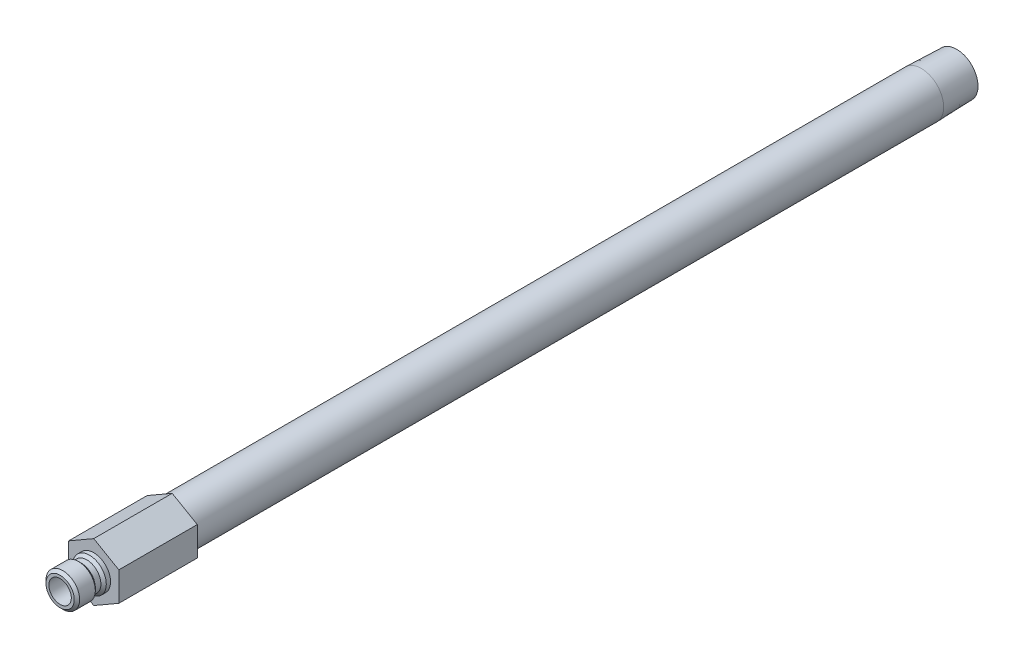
ISO-10303-21;
HEADER;
FILE_DESCRIPTION(('STEP AP214'),'2;1');
FILE_NAME('part.step','',(''),(''),'','','');
FILE_SCHEMA(('AUTOMOTIVE_DESIGN { 1 0 10303 214 1 1 1 1 }'));
ENDSEC;
DATA;
#1=APPLICATION_CONTEXT('core data for automotive mechanical design processes');
#2=APPLICATION_PROTOCOL_DEFINITION('international standard','automotive_design',2000,#1);
#3=PRODUCT_CONTEXT('',#1,'mechanical');
#4=PRODUCT('Part','Part','',(#3));
#5=PRODUCT_RELATED_PRODUCT_CATEGORY('part','',(#4));
#6=PRODUCT_DEFINITION_FORMATION('','',#4);
#7=PRODUCT_DEFINITION_CONTEXT('part definition',#1,'design');
#8=PRODUCT_DEFINITION('design','',#6,#7);
#9=PRODUCT_DEFINITION_SHAPE('','',#8);
#10=(LENGTH_UNIT() NAMED_UNIT(*) SI_UNIT(.MILLI.,.METRE.));
#11=(NAMED_UNIT(*) PLANE_ANGLE_UNIT() SI_UNIT($,.RADIAN.));
#12=(NAMED_UNIT(*) SI_UNIT($,.STERADIAN.) SOLID_ANGLE_UNIT());
#13=UNCERTAINTY_MEASURE_WITH_UNIT(LENGTH_MEASURE(1.E-05),#10,'distance_accuracy_value','');
#14=(GEOMETRIC_REPRESENTATION_CONTEXT(3) GLOBAL_UNCERTAINTY_ASSIGNED_CONTEXT((#13)) GLOBAL_UNIT_ASSIGNED_CONTEXT((#10,
#11,#12)) REPRESENTATION_CONTEXT('',''));
#15=CARTESIAN_POINT('',(0.,0.,0.));
#16=DIRECTION('',(0.,0.,1.));
#17=DIRECTION('',(1.,0.,0.));
#18=AXIS2_PLACEMENT_3D('',#15,#16,#17);
#19=CARTESIAN_POINT('',(0.,0.,0.));
#20=DIRECTION('',(0.,0.,-1.));
#21=DIRECTION('',(0.,1.,0.));
#22=AXIS2_PLACEMENT_3D('',#19,#20,#21);
#23=CYLINDRICAL_SURFACE('',#22,6.34999999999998);
#24=CARTESIAN_POINT('',(0.,0.,-234.442));
#25=DIRECTION('',(0.,0.,-1.));
#26=DIRECTION('',(0.,1.,0.));
#27=AXIS2_PLACEMENT_3D('',#24,#25,#26);
#28=CIRCLE('',#27,6.34999999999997);
#29=CARTESIAN_POINT('',(0.,6.35,-234.442));
#30=VERTEX_POINT('',#29);
#31=EDGE_CURVE('E41',#30,#30,#28,.T.);
#32=ORIENTED_EDGE('',*,*,#31,.F.);
#33=EDGE_LOOP('',(#32));
#34=FACE_BOUND('',#33,.T.);
#35=CARTESIAN_POINT('',(0.,0.,-22.225));
#36=DIRECTION('',(0.,0.,1.));
#37=DIRECTION('',(1.,0.,0.));
#38=AXIS2_PLACEMENT_3D('',#35,#36,#37);
#39=CIRCLE('',#38,6.34999999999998);
#40=CARTESIAN_POINT('',(6.34999999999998,0.,-22.225));
#41=VERTEX_POINT('',#40);
#42=EDGE_CURVE('E137',#41,#41,#39,.F.);
#43=ORIENTED_EDGE('',*,*,#42,.T.);
#44=EDGE_LOOP('',(#43));
#45=FACE_BOUND('',#44,.T.);
#46=ADVANCED_FACE('F32',(#34,#45),#23,.T.);
#47=CARTESIAN_POINT('',(0.,6.03647060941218,-244.475));
#48=DIRECTION('',(0.,0.,-1.));
#49=DIRECTION('',(0.,1.,0.));
#50=AXIS2_PLACEMENT_3D('',#47,#48,#49);
#51=PLANE('',#50);
#52=CARTESIAN_POINT('',(0.,0.,-244.475));
#53=DIRECTION('',(0.,0.,-1.));
#54=DIRECTION('',(0.,1.,0.));
#55=AXIS2_PLACEMENT_3D('',#52,#53,#54);
#56=CIRCLE('',#55,6.03647060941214);
#57=CARTESIAN_POINT('',(0.,6.03647060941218,-244.475));
#58=VERTEX_POINT('',#57);
#59=EDGE_CURVE('E11',#58,#58,#56,.T.);
#60=ORIENTED_EDGE('',*,*,#59,.T.);
#61=EDGE_LOOP('',(#60));
#62=FACE_BOUND('',#61,.T.);
#63=CARTESIAN_POINT('',(0.,0.,-244.475));
#64=DIRECTION('',(0.,0.,-1.));
#65=DIRECTION('',(0.,1.,0.));
#66=AXIS2_PLACEMENT_3D('',#63,#64,#65);
#67=CIRCLE('',#66,4.62279999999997);
#68=CARTESIAN_POINT('',(0.,4.6228,-244.475));
#69=VERTEX_POINT('',#68);
#70=EDGE_CURVE('E145',#69,#69,#67,.T.);
#71=ORIENTED_EDGE('',*,*,#70,.F.);
#72=EDGE_LOOP('',(#71));
#73=FACE_BOUND('',#72,.T.);
#74=ADVANCED_FACE('F34',(#62,#73),#51,.T.);
#75=CARTESIAN_POINT('',(0.,0.,-244.475));
#76=DIRECTION('',(0.,0.,1.));
#77=DIRECTION('',(0.,-1.,0.));
#78=AXIS2_PLACEMENT_3D('',#75,#76,#77);
#79=CONICAL_SURFACE('',#78,6.03647060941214,0.0312396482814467);
#80=ORIENTED_EDGE('',*,*,#31,.T.);
#81=EDGE_LOOP('',(#80));
#82=FACE_BOUND('',#81,.T.);
#83=ORIENTED_EDGE('',*,*,#59,.F.);
#84=EDGE_LOOP('',(#83));
#85=FACE_BOUND('',#84,.T.);
#86=ADVANCED_FACE('F180',(#82,#85),#79,.T.);
#87=CARTESIAN_POINT('',(0.,4.7625,0.));
#88=DIRECTION('',(0.,0.,1.));
#89=DIRECTION('',(0.,-1.,0.));
#90=AXIS2_PLACEMENT_3D('',#87,#88,#89);
#91=PLANE('',#90);
#92=CARTESIAN_POINT('',(0.,0.,0.));
#93=DIRECTION('',(0.,0.,-1.));
#94=DIRECTION('',(0.,1.,0.));
#95=AXIS2_PLACEMENT_3D('',#92,#93,#94);
#96=CIRCLE('',#95,4.7625);
#97=CARTESIAN_POINT('',(0.,4.7625,0.));
#98=VERTEX_POINT('',#97);
#99=EDGE_CURVE('E175',#98,#98,#96,.T.);
#100=ORIENTED_EDGE('',*,*,#99,.T.);
#101=EDGE_LOOP('',(#100));
#102=FACE_BOUND('',#101,.T.);
#103=DIRECTION('',(-0.866025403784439,-0.5,0.));
#104=VECTOR('',#103,1.);
#105=CARTESIAN_POINT('',(0.,8.21223022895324,0.));
#106=LINE('',#105,#104);
#107=CARTESIAN_POINT('',(0.,8.21223022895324,0.));
#108=VERTEX_POINT('',#107);
#109=CARTESIAN_POINT('',(-7.112,4.10611511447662,0.));
#110=VERTEX_POINT('',#109);
#111=EDGE_CURVE('E120',#108,#110,#106,.T.);
#112=ORIENTED_EDGE('',*,*,#111,.T.);
#113=DIRECTION('',(0.,-1.,0.));
#114=VECTOR('',#113,1.);
#115=CARTESIAN_POINT('',(-7.112,4.10611511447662,0.));
#116=LINE('',#115,#114);
#117=CARTESIAN_POINT('',(-7.112,-4.10611511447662,0.));
#118=VERTEX_POINT('',#117);
#119=EDGE_CURVE('E123',#110,#118,#116,.T.);
#120=ORIENTED_EDGE('',*,*,#119,.T.);
#121=DIRECTION('',(0.866025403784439,-0.5,0.));
#122=VECTOR('',#121,1.);
#123=CARTESIAN_POINT('',(-7.112,-4.10611511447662,0.));
#124=LINE('',#123,#122);
#125=CARTESIAN_POINT('',(0.,-8.21223022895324,0.));
#126=VERTEX_POINT('',#125);
#127=EDGE_CURVE('E126',#118,#126,#124,.T.);
#128=ORIENTED_EDGE('',*,*,#127,.T.);
#129=DIRECTION('',(0.866025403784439,0.5,0.));
#130=VECTOR('',#129,1.);
#131=CARTESIAN_POINT('',(0.,-8.21223022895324,0.));
#132=LINE('',#131,#130);
#133=CARTESIAN_POINT('',(7.112,-4.10611511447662,0.));
#134=VERTEX_POINT('',#133);
#135=EDGE_CURVE('E129',#126,#134,#132,.T.);
#136=ORIENTED_EDGE('',*,*,#135,.T.);
#137=DIRECTION('',(0.,1.,0.));
#138=VECTOR('',#137,1.);
#139=CARTESIAN_POINT('',(7.112,-4.10611511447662,0.));
#140=LINE('',#139,#138);
#141=CARTESIAN_POINT('',(7.112,4.10611511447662,0.));
#142=VERTEX_POINT('',#141);
#143=EDGE_CURVE('E97',#134,#142,#140,.T.);
#144=ORIENTED_EDGE('',*,*,#143,.T.);
#145=DIRECTION('',(-0.866025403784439,0.5,0.));
#146=VECTOR('',#145,1.);
#147=CARTESIAN_POINT('',(7.112,4.10611511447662,0.));
#148=LINE('',#147,#146);
#149=EDGE_CURVE('E132',#142,#108,#148,.T.);
#150=ORIENTED_EDGE('',*,*,#149,.T.);
#151=EDGE_LOOP('',(#112,#120,#128,#136,#144,#150));
#152=FACE_BOUND('',#151,.T.);
#153=ADVANCED_FACE('F249',(#102,#152),#91,.T.);
#154=CARTESIAN_POINT('',(0.,0.,0.));
#155=DIRECTION('',(0.,0.,-1.));
#156=DIRECTION('',(0.,1.,0.));
#157=AXIS2_PLACEMENT_3D('',#154,#155,#156);
#158=CYLINDRICAL_SURFACE('',#157,4.7625);
#159=CARTESIAN_POINT('',(0.,0.,1.2065));
#160=DIRECTION('',(0.,0.,-1.));
#161=DIRECTION('',(0.,1.,0.));
#162=AXIS2_PLACEMENT_3D('',#159,#160,#161);
#163=CIRCLE('',#162,4.7625);
#164=CARTESIAN_POINT('',(0.,4.7625,1.2065));
#165=VERTEX_POINT('',#164);
#166=EDGE_CURVE('E172',#165,#165,#163,.T.);
#167=ORIENTED_EDGE('',*,*,#166,.T.);
#168=EDGE_LOOP('',(#167));
#169=FACE_BOUND('',#168,.T.);
#170=ORIENTED_EDGE('',*,*,#99,.F.);
#171=EDGE_LOOP('',(#170));
#172=FACE_BOUND('',#171,.T.);
#173=ADVANCED_FACE('F245',(#169,#172),#158,.T.);
#174=CARTESIAN_POINT('',(0.,0.,1.2065));
#175=DIRECTION('',(0.,0.,-1.));
#176=DIRECTION('',(0.,1.,0.));
#177=AXIS2_PLACEMENT_3D('',#174,#175,#176);
#178=CONICAL_SURFACE('',#177,4.7625,0.785398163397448);
#179=CARTESIAN_POINT('',(0.,0.,1.9685));
#180=DIRECTION('',(0.,0.,-1.));
#181=DIRECTION('',(0.,1.,0.));
#182=AXIS2_PLACEMENT_3D('',#179,#180,#181);
#183=CIRCLE('',#182,4.0005);
#184=CARTESIAN_POINT('',(0.,4.0005,1.9685));
#185=VERTEX_POINT('',#184);
#186=EDGE_CURVE('E169',#185,#185,#183,.T.);
#187=ORIENTED_EDGE('',*,*,#186,.T.);
#188=EDGE_LOOP('',(#187));
#189=FACE_BOUND('',#188,.T.);
#190=ORIENTED_EDGE('',*,*,#166,.F.);
#191=EDGE_LOOP('',(#190));
#192=FACE_BOUND('',#191,.T.);
#193=ADVANCED_FACE('F241',(#189,#192),#178,.T.);
#194=CARTESIAN_POINT('',(0.,0.,0.));
#195=DIRECTION('',(0.,0.,-1.));
#196=DIRECTION('',(0.,1.,0.));
#197=AXIS2_PLACEMENT_3D('',#194,#195,#196);
#198=CYLINDRICAL_SURFACE('',#197,4.0005);
#199=CARTESIAN_POINT('',(0.,0.,3.556));
#200=DIRECTION('',(0.,0.,-1.));
#201=DIRECTION('',(0.,1.,0.));
#202=AXIS2_PLACEMENT_3D('',#199,#200,#201);
#203=CIRCLE('',#202,4.0005);
#204=CARTESIAN_POINT('',(0.,4.0005,3.556));
#205=VERTEX_POINT('',#204);
#206=EDGE_CURVE('E166',#205,#205,#203,.T.);
#207=ORIENTED_EDGE('',*,*,#206,.T.);
#208=EDGE_LOOP('',(#207));
#209=FACE_BOUND('',#208,.T.);
#210=ORIENTED_EDGE('',*,*,#186,.F.);
#211=EDGE_LOOP('',(#210));
#212=FACE_BOUND('',#211,.T.);
#213=ADVANCED_FACE('F237',(#209,#212),#198,.T.);
#214=CARTESIAN_POINT('',(0.,0.,3.556));
#215=DIRECTION('',(0.,0.,1.));
#216=DIRECTION('',(0.,-1.,0.));
#217=AXIS2_PLACEMENT_3D('',#214,#215,#216);
#218=CONICAL_SURFACE('',#217,4.0005,0.785398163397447);
#219=CARTESIAN_POINT('',(0.,0.,4.318));
#220=DIRECTION('',(0.,0.,-1.));
#221=DIRECTION('',(0.,1.,0.));
#222=AXIS2_PLACEMENT_3D('',#219,#220,#221);
#223=CIRCLE('',#222,4.7625);
#224=CARTESIAN_POINT('',(0.,4.7625,4.318));
#225=VERTEX_POINT('',#224);
#226=EDGE_CURVE('E163',#225,#225,#223,.T.);
#227=ORIENTED_EDGE('',*,*,#226,.T.);
#228=EDGE_LOOP('',(#227));
#229=FACE_BOUND('',#228,.T.);
#230=ORIENTED_EDGE('',*,*,#206,.F.);
#231=EDGE_LOOP('',(#230));
#232=FACE_BOUND('',#231,.T.);
#233=ADVANCED_FACE('F233',(#229,#232),#218,.T.);
#234=CARTESIAN_POINT('',(0.,0.,0.));
#235=DIRECTION('',(0.,0.,-1.));
#236=DIRECTION('',(0.,1.,0.));
#237=AXIS2_PLACEMENT_3D('',#234,#235,#236);
#238=CYLINDRICAL_SURFACE('',#237,4.7625);
#239=CARTESIAN_POINT('',(0.,0.,8.763));
#240=DIRECTION('',(0.,0.,-1.));
#241=DIRECTION('',(0.,1.,0.));
#242=AXIS2_PLACEMENT_3D('',#239,#240,#241);
#243=CIRCLE('',#242,4.7625);
#244=CARTESIAN_POINT('',(0.,4.7625,8.763));
#245=VERTEX_POINT('',#244);
#246=EDGE_CURVE('E160',#245,#245,#243,.T.);
#247=ORIENTED_EDGE('',*,*,#246,.T.);
#248=EDGE_LOOP('',(#247));
#249=FACE_BOUND('',#248,.T.);
#250=ORIENTED_EDGE('',*,*,#226,.F.);
#251=EDGE_LOOP('',(#250));
#252=FACE_BOUND('',#251,.T.);
#253=ADVANCED_FACE('F229',(#249,#252),#238,.T.);
#254=CARTESIAN_POINT('',(0.,0.,8.763));
#255=DIRECTION('',(0.,0.,-1.));
#256=DIRECTION('',(0.,1.,0.));
#257=AXIS2_PLACEMENT_3D('',#254,#255,#256);
#258=CONICAL_SURFACE('',#257,4.7625,0.785398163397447);
#259=CARTESIAN_POINT('',(0.,0.,9.525));
#260=DIRECTION('',(0.,0.,-1.));
#261=DIRECTION('',(0.,1.,0.));
#262=AXIS2_PLACEMENT_3D('',#259,#260,#261);
#263=CIRCLE('',#262,4.0005);
#264=CARTESIAN_POINT('',(0.,4.0005,9.525));
#265=VERTEX_POINT('',#264);
#266=EDGE_CURVE('E157',#265,#265,#263,.T.);
#267=ORIENTED_EDGE('',*,*,#266,.T.);
#268=EDGE_LOOP('',(#267));
#269=FACE_BOUND('',#268,.T.);
#270=ORIENTED_EDGE('',*,*,#246,.F.);
#271=EDGE_LOOP('',(#270));
#272=FACE_BOUND('',#271,.T.);
#273=ADVANCED_FACE('F225',(#269,#272),#258,.T.);
#274=CARTESIAN_POINT('',(0.,3.175,9.525));
#275=DIRECTION('',(0.,0.,1.));
#276=DIRECTION('',(0.,-1.,0.));
#277=AXIS2_PLACEMENT_3D('',#274,#275,#276);
#278=PLANE('',#277);
#279=CARTESIAN_POINT('',(0.,0.,9.525));
#280=DIRECTION('',(0.,0.,-1.));
#281=DIRECTION('',(0.,1.,0.));
#282=AXIS2_PLACEMENT_3D('',#279,#280,#281);
#283=CIRCLE('',#282,3.175);
#284=CARTESIAN_POINT('',(0.,3.175,9.525));
#285=VERTEX_POINT('',#284);
#286=EDGE_CURVE('E154',#285,#285,#283,.T.);
#287=ORIENTED_EDGE('',*,*,#286,.T.);
#288=EDGE_LOOP('',(#287));
#289=FACE_BOUND('',#288,.T.);
#290=ORIENTED_EDGE('',*,*,#266,.F.);
#291=EDGE_LOOP('',(#290));
#292=FACE_BOUND('',#291,.T.);
#293=ADVANCED_FACE('F221',(#289,#292),#278,.T.);
#294=CARTESIAN_POINT('',(0.,0.,0.));
#295=DIRECTION('',(0.,0.,-1.));
#296=DIRECTION('',(0.,1.,0.));
#297=AXIS2_PLACEMENT_3D('',#294,#295,#296);
#298=CYLINDRICAL_SURFACE('',#297,3.175);
#299=ORIENTED_EDGE('',*,*,#286,.F.);
#300=EDGE_LOOP('',(#299));
#301=FACE_BOUND('',#300,.T.);
#302=CARTESIAN_POINT('',(0.,0.,-22.225));
#303=DIRECTION('',(0.,0.,-1.));
#304=DIRECTION('',(0.,1.,0.));
#305=AXIS2_PLACEMENT_3D('',#302,#303,#304);
#306=CIRCLE('',#305,3.175);
#307=CARTESIAN_POINT('',(0.,3.175,-22.225));
#308=VERTEX_POINT('',#307);
#309=EDGE_CURVE('E151',#308,#308,#306,.T.);
#310=ORIENTED_EDGE('',*,*,#309,.T.);
#311=EDGE_LOOP('',(#310));
#312=FACE_BOUND('',#311,.T.);
#313=ADVANCED_FACE('F217',(#301,#312),#298,.F.);
#314=CARTESIAN_POINT('',(0.,4.6228,-22.225));
#315=DIRECTION('',(0.,0.,-1.));
#316=DIRECTION('',(0.,1.,0.));
#317=AXIS2_PLACEMENT_3D('',#314,#315,#316);
#318=PLANE('',#317);
#319=CARTESIAN_POINT('',(0.,0.,-22.225));
#320=DIRECTION('',(0.,0.,-1.));
#321=DIRECTION('',(0.,1.,0.));
#322=AXIS2_PLACEMENT_3D('',#319,#320,#321);
#323=CIRCLE('',#322,4.6228);
#324=CARTESIAN_POINT('',(0.,4.6228,-22.225));
#325=VERTEX_POINT('',#324);
#326=EDGE_CURVE('E148',#325,#325,#323,.T.);
#327=ORIENTED_EDGE('',*,*,#326,.T.);
#328=EDGE_LOOP('',(#327));
#329=FACE_BOUND('',#328,.T.);
#330=ORIENTED_EDGE('',*,*,#309,.F.);
#331=EDGE_LOOP('',(#330));
#332=FACE_BOUND('',#331,.T.);
#333=ADVANCED_FACE('F198',(#329,#332),#318,.T.);
#334=CARTESIAN_POINT('',(0.,0.,0.));
#335=DIRECTION('',(0.,0.,-1.));
#336=DIRECTION('',(0.,1.,0.));
#337=AXIS2_PLACEMENT_3D('',#334,#335,#336);
#338=CYLINDRICAL_SURFACE('',#337,4.62279999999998);
#339=ORIENTED_EDGE('',*,*,#70,.T.);
#340=EDGE_LOOP('',(#339));
#341=FACE_BOUND('',#340,.T.);
#342=ORIENTED_EDGE('',*,*,#326,.F.);
#343=EDGE_LOOP('',(#342));
#344=FACE_BOUND('',#343,.T.);
#345=ADVANCED_FACE('F190',(#341,#344),#338,.F.);
#346=CARTESIAN_POINT('',(-7.112,4.10611511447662,-22.225));
#347=DIRECTION('',(0.,0.,1.));
#348=DIRECTION('',(1.,0.,0.));
#349=AXIS2_PLACEMENT_3D('',#346,#347,#348);
#350=PLANE('',#349);
#351=ORIENTED_EDGE('',*,*,#42,.F.);
#352=EDGE_LOOP('',(#351));
#353=FACE_BOUND('',#352,.T.);
#354=DIRECTION('',(-0.866025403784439,-0.5,0.));
#355=VECTOR('',#354,1.);
#356=CARTESIAN_POINT('',(0.,8.21223022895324,-22.225));
#357=LINE('',#356,#355);
#358=CARTESIAN_POINT('',(0.,8.21223022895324,-22.225));
#359=VERTEX_POINT('',#358);
#360=CARTESIAN_POINT('',(-7.112,4.10611511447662,-22.225));
#361=VERTEX_POINT('',#360);
#362=EDGE_CURVE('E135',#359,#361,#357,.T.);
#363=ORIENTED_EDGE('',*,*,#362,.F.);
#364=DIRECTION('',(-0.866025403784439,0.5,0.));
#365=VECTOR('',#364,1.);
#366=CARTESIAN_POINT('',(7.112,4.10611511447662,-22.225));
#367=LINE('',#366,#365);
#368=CARTESIAN_POINT('',(7.112,4.10611511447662,-22.225));
#369=VERTEX_POINT('',#368);
#370=EDGE_CURVE('E110',#369,#359,#367,.T.);
#371=ORIENTED_EDGE('',*,*,#370,.F.);
#372=DIRECTION('',(0.,1.,0.));
#373=VECTOR('',#372,1.);
#374=CARTESIAN_POINT('',(7.112,-4.10611511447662,-22.225));
#375=LINE('',#374,#373);
#376=CARTESIAN_POINT('',(7.112,-4.10611511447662,-22.225));
#377=VERTEX_POINT('',#376);
#378=EDGE_CURVE('E95',#377,#369,#375,.T.);
#379=ORIENTED_EDGE('',*,*,#378,.F.);
#380=DIRECTION('',(0.866025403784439,0.5,0.));
#381=VECTOR('',#380,1.);
#382=CARTESIAN_POINT('',(0.,-8.21223022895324,-22.225));
#383=LINE('',#382,#381);
#384=CARTESIAN_POINT('',(0.,-8.21223022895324,-22.225));
#385=VERTEX_POINT('',#384);
#386=EDGE_CURVE('E108',#385,#377,#383,.T.);
#387=ORIENTED_EDGE('',*,*,#386,.F.);
#388=DIRECTION('',(0.866025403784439,-0.5,0.));
#389=VECTOR('',#388,1.);
#390=CARTESIAN_POINT('',(-7.112,-4.10611511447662,-22.225));
#391=LINE('',#390,#389);
#392=CARTESIAN_POINT('',(-7.112,-4.10611511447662,-22.225));
#393=VERTEX_POINT('',#392);
#394=EDGE_CURVE('E113',#393,#385,#391,.T.);
#395=ORIENTED_EDGE('',*,*,#394,.F.);
#396=DIRECTION('',(0.,-1.,0.));
#397=VECTOR('',#396,1.);
#398=CARTESIAN_POINT('',(-7.112,4.10611511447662,-22.225));
#399=LINE('',#398,#397);
#400=EDGE_CURVE('E115',#361,#393,#399,.T.);
#401=ORIENTED_EDGE('',*,*,#400,.F.);
#402=EDGE_LOOP('',(#363,#371,#379,#387,#395,#401));
#403=FACE_BOUND('',#402,.T.);
#404=ADVANCED_FACE('F106',(#353,#403),#350,.F.);
#405=CARTESIAN_POINT('',(0.,8.21223022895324,-22.225));
#406=DIRECTION('',(-0.5,0.866025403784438,0.));
#407=DIRECTION('',(-0.866025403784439,-0.5,0.));
#408=AXIS2_PLACEMENT_3D('',#405,#406,#407);
#409=PLANE('',#408);
#410=ORIENTED_EDGE('',*,*,#111,.F.);
#411=DIRECTION('',(0.,0.,1.));
#412=VECTOR('',#411,1.);
#413=CARTESIAN_POINT('',(0.,8.21223022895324,-22.225));
#414=LINE('',#413,#412);
#415=EDGE_CURVE('E49',#359,#108,#414,.T.);
#416=ORIENTED_EDGE('',*,*,#415,.F.);
#417=ORIENTED_EDGE('',*,*,#362,.T.);
#418=DIRECTION('',(0.,0.,1.));
#419=VECTOR('',#418,1.);
#420=CARTESIAN_POINT('',(-7.112,4.10611511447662,-22.225));
#421=LINE('',#420,#419);
#422=EDGE_CURVE('E84',#361,#110,#421,.T.);
#423=ORIENTED_EDGE('',*,*,#422,.T.);
#424=EDGE_LOOP('',(#410,#416,#417,#423));
#425=FACE_BOUND('',#424,.T.);
#426=ADVANCED_FACE('F189',(#425),#409,.T.);
#427=CARTESIAN_POINT('',(7.112,4.10611511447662,-22.225));
#428=DIRECTION('',(0.5,0.866025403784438,0.));
#429=DIRECTION('',(-0.866025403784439,0.5,0.));
#430=AXIS2_PLACEMENT_3D('',#427,#428,#429);
#431=PLANE('',#430);
#432=ORIENTED_EDGE('',*,*,#149,.F.);
#433=DIRECTION('',(0.,0.,1.));
#434=VECTOR('',#433,1.);
#435=CARTESIAN_POINT('',(7.112,4.10611511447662,-22.225));
#436=LINE('',#435,#434);
#437=EDGE_CURVE('E72',#369,#142,#436,.T.);
#438=ORIENTED_EDGE('',*,*,#437,.F.);
#439=ORIENTED_EDGE('',*,*,#370,.T.);
#440=ORIENTED_EDGE('',*,*,#415,.T.);
#441=EDGE_LOOP('',(#432,#438,#439,#440));
#442=FACE_BOUND('',#441,.T.);
#443=ADVANCED_FACE('F196',(#442),#431,.T.);
#444=CARTESIAN_POINT('',(7.112,-4.10611511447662,-22.225));
#445=DIRECTION('',(1.,0.,0.));
#446=DIRECTION('',(0.,1.,0.));
#447=AXIS2_PLACEMENT_3D('',#444,#445,#446);
#448=PLANE('',#447);
#449=ORIENTED_EDGE('',*,*,#143,.F.);
#450=DIRECTION('',(0.,0.,1.));
#451=VECTOR('',#450,1.);
#452=CARTESIAN_POINT('',(7.112,-4.10611511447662,-22.225));
#453=LINE('',#452,#451);
#454=EDGE_CURVE('E92',#377,#134,#453,.T.);
#455=ORIENTED_EDGE('',*,*,#454,.F.);
#456=ORIENTED_EDGE('',*,*,#378,.T.);
#457=ORIENTED_EDGE('',*,*,#437,.T.);
#458=EDGE_LOOP('',(#449,#455,#456,#457));
#459=FACE_BOUND('',#458,.T.);
#460=ADVANCED_FACE('F94',(#459),#448,.T.);
#461=CARTESIAN_POINT('',(0.,-8.21223022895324,-22.225));
#462=DIRECTION('',(0.5,-0.866025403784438,0.));
#463=DIRECTION('',(0.866025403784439,0.5,0.));
#464=AXIS2_PLACEMENT_3D('',#461,#462,#463);
#465=PLANE('',#464);
#466=ORIENTED_EDGE('',*,*,#135,.F.);
#467=DIRECTION('',(0.,0.,1.));
#468=VECTOR('',#467,1.);
#469=CARTESIAN_POINT('',(0.,-8.21223022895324,-22.225));
#470=LINE('',#469,#468);
#471=EDGE_CURVE('E102',#385,#126,#470,.T.);
#472=ORIENTED_EDGE('',*,*,#471,.F.);
#473=ORIENTED_EDGE('',*,*,#386,.T.);
#474=ORIENTED_EDGE('',*,*,#454,.T.);
#475=EDGE_LOOP('',(#466,#472,#473,#474));
#476=FACE_BOUND('',#475,.T.);
#477=ADVANCED_FACE('F112',(#476),#465,.T.);
#478=CARTESIAN_POINT('',(-7.112,-4.10611511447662,-22.225));
#479=DIRECTION('',(-0.5,-0.866025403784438,0.));
#480=DIRECTION('',(0.866025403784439,-0.5,0.));
#481=AXIS2_PLACEMENT_3D('',#478,#479,#480);
#482=PLANE('',#481);
#483=ORIENTED_EDGE('',*,*,#127,.F.);
#484=DIRECTION('',(0.,0.,1.));
#485=VECTOR('',#484,1.);
#486=CARTESIAN_POINT('',(-7.112,-4.10611511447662,-22.225));
#487=LINE('',#486,#485);
#488=EDGE_CURVE('E140',#393,#118,#487,.T.);
#489=ORIENTED_EDGE('',*,*,#488,.F.);
#490=ORIENTED_EDGE('',*,*,#394,.T.);
#491=ORIENTED_EDGE('',*,*,#471,.T.);
#492=EDGE_LOOP('',(#483,#489,#490,#491));
#493=FACE_BOUND('',#492,.T.);
#494=ADVANCED_FACE('F208',(#493),#482,.T.);
#495=CARTESIAN_POINT('',(-7.112,4.10611511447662,-22.225));
#496=DIRECTION('',(-1.,0.,0.));
#497=DIRECTION('',(0.,0.,1.));
#498=AXIS2_PLACEMENT_3D('',#495,#496,#497);
#499=PLANE('',#498);
#500=ORIENTED_EDGE('',*,*,#119,.F.);
#501=ORIENTED_EDGE('',*,*,#422,.F.);
#502=ORIENTED_EDGE('',*,*,#400,.T.);
#503=ORIENTED_EDGE('',*,*,#488,.T.);
#504=EDGE_LOOP('',(#500,#501,#502,#503));
#505=FACE_BOUND('',#504,.T.);
#506=ADVANCED_FACE('F211',(#505),#499,.T.);
#507=CLOSED_SHELL('',(#46,#74,#86,#153,#173,#193,#213,#233,#253,#273,#293,#313,#333,#345,#404,
#426,#443,#460,#477,#494,#506));
#508=MANIFOLD_SOLID_BREP('B2',#507);
#509=ADVANCED_BREP_SHAPE_REPRESENTATION('',(#18,#508),#14);
#510=SHAPE_DEFINITION_REPRESENTATION(#9,#509);
ENDSEC;
END-ISO-10303-21;
